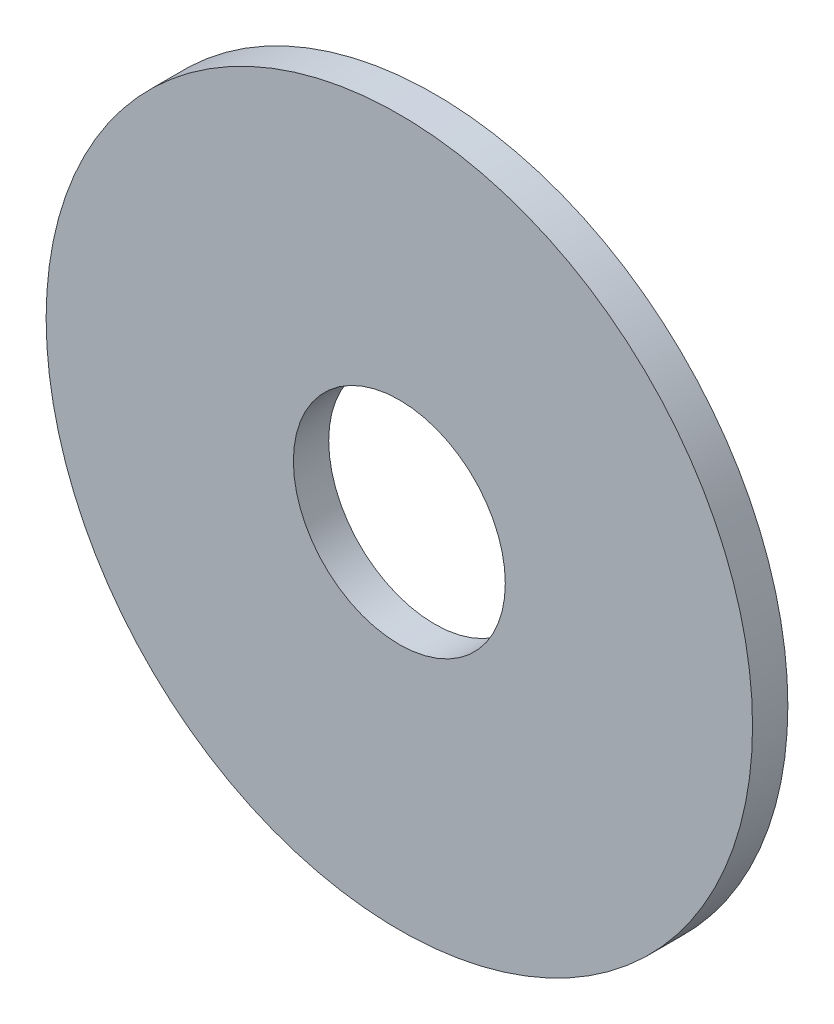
from build123d import *

# Parameters (mm, degrees)
ESQUISSE1_R          = 15
ESQUISSE1_R_2        = 4.5
BASE_EXTRUSION_DEPTH = 1.5


with BuildPart() as part:
    # Esquisse1 → Base-Extrusion (new body)
    with BuildSketch(Plane.XY):
        Circle(ESQUISSE1_R)
        Circle(ESQUISSE1_R_2, mode=Mode.SUBTRACT)
    extrude(amount=BASE_EXTRUSION_DEPTH)


solid = part.part
